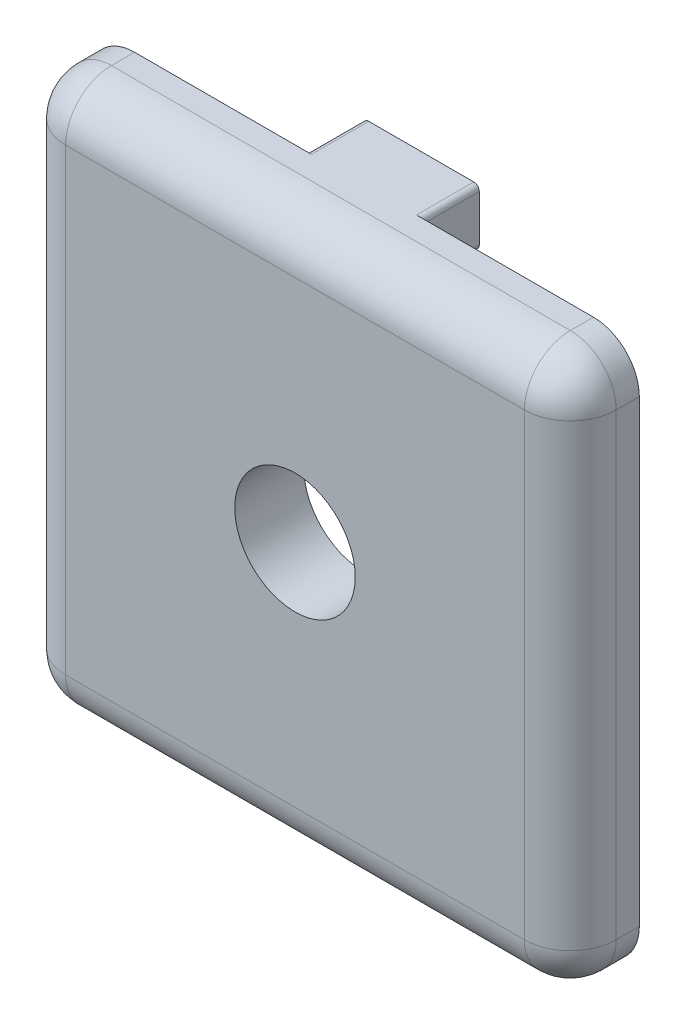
ISO-10303-21;
HEADER;
FILE_DESCRIPTION(('STEP AP214'),'2;1');
FILE_NAME('part.step','',(''),(''),'','','');
FILE_SCHEMA(('AUTOMOTIVE_DESIGN { 1 0 10303 214 1 1 1 1 }'));
ENDSEC;
DATA;
#1=APPLICATION_CONTEXT('core data for automotive mechanical design processes');
#2=APPLICATION_PROTOCOL_DEFINITION('international standard','automotive_design',2000,#1);
#3=PRODUCT_CONTEXT('',#1,'mechanical');
#4=PRODUCT('Part','Part','',(#3));
#5=PRODUCT_RELATED_PRODUCT_CATEGORY('part','',(#4));
#6=PRODUCT_DEFINITION_FORMATION('','',#4);
#7=PRODUCT_DEFINITION_CONTEXT('part definition',#1,'design');
#8=PRODUCT_DEFINITION('design','',#6,#7);
#9=PRODUCT_DEFINITION_SHAPE('','',#8);
#10=(LENGTH_UNIT() NAMED_UNIT(*) SI_UNIT(.MILLI.,.METRE.));
#11=(NAMED_UNIT(*) PLANE_ANGLE_UNIT() SI_UNIT($,.RADIAN.));
#12=(NAMED_UNIT(*) SI_UNIT($,.STERADIAN.) SOLID_ANGLE_UNIT());
#13=UNCERTAINTY_MEASURE_WITH_UNIT(LENGTH_MEASURE(1.E-05),#10,'distance_accuracy_value','');
#14=(GEOMETRIC_REPRESENTATION_CONTEXT(3) GLOBAL_UNCERTAINTY_ASSIGNED_CONTEXT((#13)) GLOBAL_UNIT_ASSIGNED_CONTEXT((#10,
#11,#12)) REPRESENTATION_CONTEXT('',''));
#15=CARTESIAN_POINT('',(0.,0.,0.));
#16=DIRECTION('',(0.,0.,1.));
#17=DIRECTION('',(1.,0.,0.));
#18=AXIS2_PLACEMENT_3D('',#15,#16,#17);
#19=CARTESIAN_POINT('',(-15.875,15.875,0.));
#20=DIRECTION('',(0.,0.,1.));
#21=DIRECTION('',(1.,0.,0.));
#22=AXIS2_PLACEMENT_3D('',#19,#20,#21);
#23=PLANE('',#22);
#24=CARTESIAN_POINT('',(0.,0.,0.));
#25=DIRECTION('',(0.,0.,1.));
#26=DIRECTION('',(1.,0.,0.));
#27=AXIS2_PLACEMENT_3D('',#24,#25,#26);
#28=CIRCLE('',#27,4.1671875);
#29=CARTESIAN_POINT('',(4.1671875,0.,0.));
#30=VERTEX_POINT('',#29);
#31=EDGE_CURVE('E524',#30,#30,#28,.T.);
#32=ORIENTED_EDGE('',*,*,#31,.T.);
#33=EDGE_LOOP('',(#32));
#34=FACE_BOUND('',#33,.T.);
#35=CARTESIAN_POINT('',(3.6322,18.669,0.));
#36=DIRECTION('',(0.,0.,-1.));
#37=DIRECTION('',(-1.,0.,0.));
#38=AXIS2_PLACEMENT_3D('',#35,#36,#37);
#39=CIRCLE('',#38,0.381);
#40=CARTESIAN_POINT('',(3.6322,19.05,0.));
#41=VERTEX_POINT('',#40);
#42=CARTESIAN_POINT('',(4.0132,18.669,0.));
#43=VERTEX_POINT('',#42);
#44=EDGE_CURVE('E491',#41,#43,#39,.T.);
#45=ORIENTED_EDGE('',*,*,#44,.F.);
#46=DIRECTION('',(-1.,0.,0.));
#47=VECTOR('',#46,1.);
#48=CARTESIAN_POINT('',(-15.875,19.05,0.));
#49=LINE('',#48,#47);
#50=CARTESIAN_POINT('',(15.875,19.05,0.));
#51=VERTEX_POINT('',#50);
#52=EDGE_CURVE('E560',#51,#41,#49,.T.);
#53=ORIENTED_EDGE('',*,*,#52,.F.);
#54=CARTESIAN_POINT('',(15.875,15.875,0.));
#55=DIRECTION('',(0.,0.,1.));
#56=DIRECTION('',(-1.,0.,0.));
#57=AXIS2_PLACEMENT_3D('',#54,#55,#56);
#58=CIRCLE('',#57,3.175);
#59=CARTESIAN_POINT('',(19.05,15.875,0.));
#60=VERTEX_POINT('',#59);
#61=EDGE_CURVE('E548',#60,#51,#58,.T.);
#62=ORIENTED_EDGE('',*,*,#61,.F.);
#63=DIRECTION('',(0.,1.,0.));
#64=VECTOR('',#63,1.);
#65=CARTESIAN_POINT('',(19.05,15.875,0.));
#66=LINE('',#65,#64);
#67=CARTESIAN_POINT('',(19.05,-15.875,0.));
#68=VERTEX_POINT('',#67);
#69=EDGE_CURVE('E545',#68,#60,#66,.T.);
#70=ORIENTED_EDGE('',*,*,#69,.F.);
#71=CARTESIAN_POINT('',(15.875,-15.875,0.));
#72=DIRECTION('',(0.,0.,1.));
#73=DIRECTION('',(1.,0.,0.));
#74=AXIS2_PLACEMENT_3D('',#71,#72,#73);
#75=CIRCLE('',#74,3.175);
#76=CARTESIAN_POINT('',(15.875,-19.05,0.));
#77=VERTEX_POINT('',#76);
#78=EDGE_CURVE('E542',#77,#68,#75,.T.);
#79=ORIENTED_EDGE('',*,*,#78,.F.);
#80=DIRECTION('',(1.,0.,0.));
#81=VECTOR('',#80,1.);
#82=CARTESIAN_POINT('',(-15.875,-19.05,0.));
#83=LINE('',#82,#81);
#84=CARTESIAN_POINT('',(-15.875,-19.05,0.));
#85=VERTEX_POINT('',#84);
#86=EDGE_CURVE('E539',#85,#77,#83,.T.);
#87=ORIENTED_EDGE('',*,*,#86,.F.);
#88=CARTESIAN_POINT('',(-15.875,-15.875,0.));
#89=DIRECTION('',(0.,0.,1.));
#90=DIRECTION('',(1.,0.,0.));
#91=AXIS2_PLACEMENT_3D('',#88,#89,#90);
#92=CIRCLE('',#91,3.175);
#93=CARTESIAN_POINT('',(-19.05,-15.875,0.));
#94=VERTEX_POINT('',#93);
#95=EDGE_CURVE('E536',#94,#85,#92,.T.);
#96=ORIENTED_EDGE('',*,*,#95,.F.);
#97=DIRECTION('',(0.,-1.,0.));
#98=VECTOR('',#97,1.);
#99=CARTESIAN_POINT('',(-19.05,15.875,0.));
#100=LINE('',#99,#98);
#101=CARTESIAN_POINT('',(-19.05,15.875,0.));
#102=VERTEX_POINT('',#101);
#103=EDGE_CURVE('E533',#102,#94,#100,.T.);
#104=ORIENTED_EDGE('',*,*,#103,.F.);
#105=CARTESIAN_POINT('',(-15.875,15.875,0.));
#106=DIRECTION('',(0.,0.,1.));
#107=DIRECTION('',(1.,0.,0.));
#108=AXIS2_PLACEMENT_3D('',#105,#106,#107);
#109=CIRCLE('',#108,3.175);
#110=CARTESIAN_POINT('',(-15.875,19.05,0.));
#111=VERTEX_POINT('',#110);
#112=EDGE_CURVE('E530',#111,#102,#109,.T.);
#113=ORIENTED_EDGE('',*,*,#112,.F.);
#114=CARTESIAN_POINT('',(-3.6322,19.05,0.));
#115=VERTEX_POINT('',#114);
#116=EDGE_CURVE('E551',#115,#111,#49,.T.);
#117=ORIENTED_EDGE('',*,*,#116,.F.);
#118=CARTESIAN_POINT('',(-3.6322,18.669,0.));
#119=DIRECTION('',(0.,0.,-1.));
#120=DIRECTION('',(1.,0.,0.));
#121=AXIS2_PLACEMENT_3D('',#118,#119,#120);
#122=CIRCLE('',#121,0.381);
#123=CARTESIAN_POINT('',(-4.0132,18.669,0.));
#124=VERTEX_POINT('',#123);
#125=EDGE_CURVE('E367',#124,#115,#122,.T.);
#126=ORIENTED_EDGE('',*,*,#125,.F.);
#127=DIRECTION('',(0.,1.,0.));
#128=VECTOR('',#127,1.);
#129=CARTESIAN_POINT('',(-4.0132,18.669,0.));
#130=LINE('',#129,#128);
#131=CARTESIAN_POINT('',(-4.0132,15.4686,0.));
#132=VERTEX_POINT('',#131);
#133=EDGE_CURVE('E371',#132,#124,#130,.T.);
#134=ORIENTED_EDGE('',*,*,#133,.F.);
#135=CARTESIAN_POINT('',(-3.6322,15.4686,0.));
#136=DIRECTION('',(0.,0.,-1.));
#137=DIRECTION('',(-1.,0.,0.));
#138=AXIS2_PLACEMENT_3D('',#135,#136,#137);
#139=CIRCLE('',#138,0.380999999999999);
#140=CARTESIAN_POINT('',(-3.6322,15.0876,0.));
#141=VERTEX_POINT('',#140);
#142=EDGE_CURVE('E712',#141,#132,#139,.T.);
#143=ORIENTED_EDGE('',*,*,#142,.F.);
#144=DIRECTION('',(-1.,0.,0.));
#145=VECTOR('',#144,1.);
#146=CARTESIAN_POINT('',(3.6322,15.0876,0.));
#147=LINE('',#146,#145);
#148=CARTESIAN_POINT('',(3.6322,15.0876,0.));
#149=VERTEX_POINT('',#148);
#150=EDGE_CURVE('E477',#149,#141,#147,.T.);
#151=ORIENTED_EDGE('',*,*,#150,.F.);
#152=CARTESIAN_POINT('',(3.6322,15.4686,0.));
#153=DIRECTION('',(0.,0.,-1.));
#154=DIRECTION('',(-1.,0.,0.));
#155=AXIS2_PLACEMENT_3D('',#152,#153,#154);
#156=CIRCLE('',#155,0.380999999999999);
#157=CARTESIAN_POINT('',(4.0132,15.4686,0.));
#158=VERTEX_POINT('',#157);
#159=EDGE_CURVE('E472',#158,#149,#156,.T.);
#160=ORIENTED_EDGE('',*,*,#159,.F.);
#161=DIRECTION('',(0.,-1.,0.));
#162=VECTOR('',#161,1.);
#163=CARTESIAN_POINT('',(4.0132,18.669,0.));
#164=LINE('',#163,#162);
#165=EDGE_CURVE('E474',#43,#158,#164,.T.);
#166=ORIENTED_EDGE('',*,*,#165,.F.);
#167=EDGE_LOOP('',(#45,#53,#62,#70,#79,#87,#96,#104,#113,#117,#126,#134,#143,#151,#160,#166));
#168=FACE_BOUND('',#167,.T.);
#169=ADVANCED_FACE('F350',(#34,#168),#23,.F.);
#170=CARTESIAN_POINT('',(-15.875,15.875,4.7752));
#171=DIRECTION('',(0.,0.,1.));
#172=DIRECTION('',(1.,0.,0.));
#173=AXIS2_PLACEMENT_3D('',#170,#171,#172);
#174=PLANE('',#173);
#175=DIRECTION('',(-1.,0.,0.));
#176=VECTOR('',#175,1.);
#177=CARTESIAN_POINT('',(-15.875,15.875,4.7752));
#178=LINE('',#177,#176);
#179=CARTESIAN_POINT('',(15.875,15.875,4.7752));
#180=VERTEX_POINT('',#179);
#181=CARTESIAN_POINT('',(-15.875,15.875,4.7752));
#182=VERTEX_POINT('',#181);
#183=EDGE_CURVE('E581',#180,#182,#178,.T.);
#184=ORIENTED_EDGE('',*,*,#183,.T.);
#185=DIRECTION('',(0.,-1.,0.));
#186=VECTOR('',#185,1.);
#187=CARTESIAN_POINT('',(-15.875,-15.875,4.7752));
#188=LINE('',#187,#186);
#189=CARTESIAN_POINT('',(-15.875,-15.875,4.7752));
#190=VERTEX_POINT('',#189);
#191=EDGE_CURVE('E574',#182,#190,#188,.T.);
#192=ORIENTED_EDGE('',*,*,#191,.T.);
#193=DIRECTION('',(1.,0.,0.));
#194=VECTOR('',#193,1.);
#195=CARTESIAN_POINT('',(15.875,-15.875,4.7752));
#196=LINE('',#195,#194);
#197=CARTESIAN_POINT('',(15.875,-15.875,4.7752));
#198=VERTEX_POINT('',#197);
#199=EDGE_CURVE('E577',#190,#198,#196,.T.);
#200=ORIENTED_EDGE('',*,*,#199,.T.);
#201=DIRECTION('',(0.,1.,0.));
#202=VECTOR('',#201,1.);
#203=CARTESIAN_POINT('',(15.875,15.875,4.7752));
#204=LINE('',#203,#202);
#205=EDGE_CURVE('E579',#198,#180,#204,.T.);
#206=ORIENTED_EDGE('',*,*,#205,.T.);
#207=EDGE_LOOP('',(#184,#192,#200,#206));
#208=FACE_BOUND('',#207,.T.);
#209=CARTESIAN_POINT('',(0.,0.,4.7752));
#210=DIRECTION('',(0.,0.,1.));
#211=DIRECTION('',(1.,0.,0.));
#212=AXIS2_PLACEMENT_3D('',#209,#210,#211);
#213=CIRCLE('',#212,4.1671875);
#214=CARTESIAN_POINT('',(4.1671875,0.,4.7752));
#215=VERTEX_POINT('',#214);
#216=EDGE_CURVE('E527',#215,#215,#213,.T.);
#217=ORIENTED_EDGE('',*,*,#216,.F.);
#218=EDGE_LOOP('',(#217));
#219=FACE_BOUND('',#218,.T.);
#220=ADVANCED_FACE('F734',(#208,#219),#174,.T.);
#221=CARTESIAN_POINT('',(-15.875,15.875,4.7752));
#222=DIRECTION('',(0.,0.,-1.));
#223=DIRECTION('',(-1.,0.,0.));
#224=AXIS2_PLACEMENT_3D('',#221,#222,#223);
#225=CYLINDRICAL_SURFACE('',#224,3.175);
#226=DIRECTION('',(0.,0.,-1.));
#227=VECTOR('',#226,1.);
#228=CARTESIAN_POINT('',(-19.05,15.875,4.7752));
#229=LINE('',#228,#227);
#230=CARTESIAN_POINT('',(-19.05,15.875,1.6002));
#231=VERTEX_POINT('',#230);
#232=EDGE_CURVE('E586',#231,#102,#229,.T.);
#233=ORIENTED_EDGE('',*,*,#232,.F.);
#234=CARTESIAN_POINT('',(-15.875,15.875,1.6002));
#235=DIRECTION('',(0.,0.,-1.));
#236=DIRECTION('',(-1.,0.,0.));
#237=AXIS2_PLACEMENT_3D('',#234,#235,#236);
#238=CIRCLE('',#237,3.175);
#239=CARTESIAN_POINT('',(-15.875,19.05,1.6002));
#240=VERTEX_POINT('',#239);
#241=EDGE_CURVE('E583',#231,#240,#238,.T.);
#242=ORIENTED_EDGE('',*,*,#241,.T.);
#243=DIRECTION('',(0.,0.,-1.));
#244=VECTOR('',#243,1.);
#245=CARTESIAN_POINT('',(-15.875,19.05,4.7752));
#246=LINE('',#245,#244);
#247=EDGE_CURVE('E554',#240,#111,#246,.T.);
#248=ORIENTED_EDGE('',*,*,#247,.T.);
#249=ORIENTED_EDGE('',*,*,#112,.T.);
#250=EDGE_LOOP('',(#233,#242,#248,#249));
#251=FACE_BOUND('',#250,.T.);
#252=ADVANCED_FACE('F352',(#251),#225,.T.);
#253=CARTESIAN_POINT('',(-19.05,15.875,4.7752));
#254=DIRECTION('',(1.,0.,0.));
#255=DIRECTION('',(0.,0.,-1.));
#256=AXIS2_PLACEMENT_3D('',#253,#254,#255);
#257=PLANE('',#256);
#258=DIRECTION('',(0.,0.,-1.));
#259=VECTOR('',#258,1.);
#260=CARTESIAN_POINT('',(-19.05,-15.875,4.7752));
#261=LINE('',#260,#259);
#262=CARTESIAN_POINT('',(-19.05,-15.875,1.6002));
#263=VERTEX_POINT('',#262);
#264=EDGE_CURVE('E588',#263,#94,#261,.T.);
#265=ORIENTED_EDGE('',*,*,#264,.F.);
#266=DIRECTION('',(0.,-1.,0.));
#267=VECTOR('',#266,1.);
#268=CARTESIAN_POINT('',(-19.05,15.875,1.6002));
#269=LINE('',#268,#267);
#270=EDGE_CURVE('E572',#263,#231,#269,.F.);
#271=ORIENTED_EDGE('',*,*,#270,.T.);
#272=ORIENTED_EDGE('',*,*,#232,.T.);
#273=ORIENTED_EDGE('',*,*,#103,.T.);
#274=EDGE_LOOP('',(#265,#271,#272,#273));
#275=FACE_BOUND('',#274,.T.);
#276=ADVANCED_FACE('F611',(#275),#257,.F.);
#277=CARTESIAN_POINT('',(-15.875,-15.875,4.7752));
#278=DIRECTION('',(0.,0.,-1.));
#279=DIRECTION('',(-1.,0.,0.));
#280=AXIS2_PLACEMENT_3D('',#277,#278,#279);
#281=CYLINDRICAL_SURFACE('',#280,3.175);
#282=DIRECTION('',(0.,0.,-1.));
#283=VECTOR('',#282,1.);
#284=CARTESIAN_POINT('',(-15.875,-19.05,4.7752));
#285=LINE('',#284,#283);
#286=CARTESIAN_POINT('',(-15.875,-19.05,1.6002));
#287=VERTEX_POINT('',#286);
#288=EDGE_CURVE('E590',#287,#85,#285,.T.);
#289=ORIENTED_EDGE('',*,*,#288,.F.);
#290=CARTESIAN_POINT('',(-15.875,-15.875,1.6002));
#291=DIRECTION('',(0.,0.,-1.));
#292=DIRECTION('',(-1.,0.,0.));
#293=AXIS2_PLACEMENT_3D('',#290,#291,#292);
#294=CIRCLE('',#293,3.175);
#295=EDGE_CURVE('E570',#287,#263,#294,.T.);
#296=ORIENTED_EDGE('',*,*,#295,.T.);
#297=ORIENTED_EDGE('',*,*,#264,.T.);
#298=ORIENTED_EDGE('',*,*,#95,.T.);
#299=EDGE_LOOP('',(#289,#296,#297,#298));
#300=FACE_BOUND('',#299,.T.);
#301=ADVANCED_FACE('F664',(#300),#281,.T.);
#302=CARTESIAN_POINT('',(-15.875,-19.05,4.7752));
#303=DIRECTION('',(0.,1.,0.));
#304=DIRECTION('',(0.,0.,1.));
#305=AXIS2_PLACEMENT_3D('',#302,#303,#304);
#306=PLANE('',#305);
#307=DIRECTION('',(0.,0.,-1.));
#308=VECTOR('',#307,1.);
#309=CARTESIAN_POINT('',(15.875,-19.05,4.7752));
#310=LINE('',#309,#308);
#311=CARTESIAN_POINT('',(15.875,-19.05,1.6002));
#312=VERTEX_POINT('',#311);
#313=EDGE_CURVE('E592',#312,#77,#310,.T.);
#314=ORIENTED_EDGE('',*,*,#313,.F.);
#315=DIRECTION('',(1.,0.,0.));
#316=VECTOR('',#315,1.);
#317=CARTESIAN_POINT('',(-15.875,-19.05,1.6002));
#318=LINE('',#317,#316);
#319=EDGE_CURVE('E568',#312,#287,#318,.F.);
#320=ORIENTED_EDGE('',*,*,#319,.T.);
#321=ORIENTED_EDGE('',*,*,#288,.T.);
#322=ORIENTED_EDGE('',*,*,#86,.T.);
#323=EDGE_LOOP('',(#314,#320,#321,#322));
#324=FACE_BOUND('',#323,.T.);
#325=ADVANCED_FACE('F662',(#324),#306,.F.);
#326=CARTESIAN_POINT('',(15.875,-15.875,4.7752));
#327=DIRECTION('',(0.,0.,-1.));
#328=DIRECTION('',(-1.,0.,0.));
#329=AXIS2_PLACEMENT_3D('',#326,#327,#328);
#330=CYLINDRICAL_SURFACE('',#329,3.175);
#331=DIRECTION('',(0.,0.,-1.));
#332=VECTOR('',#331,1.);
#333=CARTESIAN_POINT('',(19.05,-15.875,4.7752));
#334=LINE('',#333,#332);
#335=CARTESIAN_POINT('',(19.05,-15.875,1.6002));
#336=VERTEX_POINT('',#335);
#337=EDGE_CURVE('E594',#336,#68,#334,.T.);
#338=ORIENTED_EDGE('',*,*,#337,.F.);
#339=CARTESIAN_POINT('',(15.875,-15.875,1.6002));
#340=DIRECTION('',(0.,0.,-1.));
#341=DIRECTION('',(-1.,0.,0.));
#342=AXIS2_PLACEMENT_3D('',#339,#340,#341);
#343=CIRCLE('',#342,3.175);
#344=EDGE_CURVE('E566',#336,#312,#343,.T.);
#345=ORIENTED_EDGE('',*,*,#344,.T.);
#346=ORIENTED_EDGE('',*,*,#313,.T.);
#347=ORIENTED_EDGE('',*,*,#78,.T.);
#348=EDGE_LOOP('',(#338,#345,#346,#347));
#349=FACE_BOUND('',#348,.T.);
#350=ADVANCED_FACE('F647',(#349),#330,.T.);
#351=CARTESIAN_POINT('',(19.05,15.875,4.7752));
#352=DIRECTION('',(-1.,0.,0.));
#353=DIRECTION('',(0.,0.,1.));
#354=AXIS2_PLACEMENT_3D('',#351,#352,#353);
#355=PLANE('',#354);
#356=DIRECTION('',(0.,0.,-1.));
#357=VECTOR('',#356,1.);
#358=CARTESIAN_POINT('',(19.05,15.875,4.7752));
#359=LINE('',#358,#357);
#360=CARTESIAN_POINT('',(19.05,15.875,1.6002));
#361=VERTEX_POINT('',#360);
#362=EDGE_CURVE('E596',#361,#60,#359,.T.);
#363=ORIENTED_EDGE('',*,*,#362,.F.);
#364=DIRECTION('',(0.,1.,0.));
#365=VECTOR('',#364,1.);
#366=CARTESIAN_POINT('',(19.05,-15.875,1.6002));
#367=LINE('',#366,#365);
#368=EDGE_CURVE('E564',#361,#336,#367,.F.);
#369=ORIENTED_EDGE('',*,*,#368,.T.);
#370=ORIENTED_EDGE('',*,*,#337,.T.);
#371=ORIENTED_EDGE('',*,*,#69,.T.);
#372=EDGE_LOOP('',(#363,#369,#370,#371));
#373=FACE_BOUND('',#372,.T.);
#374=ADVANCED_FACE('F644',(#373),#355,.F.);
#375=CARTESIAN_POINT('',(15.875,15.875,4.7752));
#376=DIRECTION('',(0.,0.,-1.));
#377=DIRECTION('',(-1.,0.,0.));
#378=AXIS2_PLACEMENT_3D('',#375,#376,#377);
#379=CYLINDRICAL_SURFACE('',#378,3.175);
#380=DIRECTION('',(0.,0.,-1.));
#381=VECTOR('',#380,1.);
#382=CARTESIAN_POINT('',(15.875,19.05,4.7752));
#383=LINE('',#382,#381);
#384=CARTESIAN_POINT('',(15.875,19.05,1.6002));
#385=VERTEX_POINT('',#384);
#386=EDGE_CURVE('E597',#385,#51,#383,.T.);
#387=ORIENTED_EDGE('',*,*,#386,.F.);
#388=CARTESIAN_POINT('',(15.875,15.875,1.6002));
#389=DIRECTION('',(0.,0.,-1.));
#390=DIRECTION('',(-1.,0.,0.));
#391=AXIS2_PLACEMENT_3D('',#388,#389,#390);
#392=CIRCLE('',#391,3.175);
#393=EDGE_CURVE('E359',#385,#361,#392,.T.);
#394=ORIENTED_EDGE('',*,*,#393,.T.);
#395=ORIENTED_EDGE('',*,*,#362,.T.);
#396=ORIENTED_EDGE('',*,*,#61,.T.);
#397=EDGE_LOOP('',(#387,#394,#395,#396));
#398=FACE_BOUND('',#397,.T.);
#399=ADVANCED_FACE('F630',(#398),#379,.T.);
#400=CARTESIAN_POINT('',(-15.875,19.05,4.7752));
#401=DIRECTION('',(0.,-1.,0.));
#402=DIRECTION('',(0.,0.,-1.));
#403=AXIS2_PLACEMENT_3D('',#400,#401,#402);
#404=PLANE('',#403);
#405=ORIENTED_EDGE('',*,*,#247,.F.);
#406=DIRECTION('',(-1.,0.,0.));
#407=VECTOR('',#406,1.);
#408=CARTESIAN_POINT('',(15.875,19.05,1.6002));
#409=LINE('',#408,#407);
#410=EDGE_CURVE('E11',#240,#385,#409,.F.);
#411=ORIENTED_EDGE('',*,*,#410,.T.);
#412=ORIENTED_EDGE('',*,*,#386,.T.);
#413=ORIENTED_EDGE('',*,*,#52,.T.);
#414=DIRECTION('',(0.,0.,1.));
#415=VECTOR('',#414,1.);
#416=CARTESIAN_POINT('',(3.6322,19.05,-3.9624));
#417=LINE('',#416,#415);
#418=CARTESIAN_POINT('',(3.6322,19.05,-3.9624));
#419=VERTEX_POINT('',#418);
#420=EDGE_CURVE('E668',#419,#41,#417,.T.);
#421=ORIENTED_EDGE('',*,*,#420,.F.);
#422=DIRECTION('',(1.,0.,0.));
#423=VECTOR('',#422,1.);
#424=CARTESIAN_POINT('',(3.6322,19.05,-3.9624));
#425=LINE('',#424,#423);
#426=CARTESIAN_POINT('',(-3.6322,19.05,-3.9624));
#427=VERTEX_POINT('',#426);
#428=EDGE_CURVE('E675',#427,#419,#425,.T.);
#429=ORIENTED_EDGE('',*,*,#428,.F.);
#430=DIRECTION('',(0.,0.,1.));
#431=VECTOR('',#430,1.);
#432=CARTESIAN_POINT('',(-3.6322,19.05,-3.9624));
#433=LINE('',#432,#431);
#434=EDGE_CURVE('E674',#427,#115,#433,.T.);
#435=ORIENTED_EDGE('',*,*,#434,.T.);
#436=ORIENTED_EDGE('',*,*,#116,.T.);
#437=EDGE_LOOP('',(#405,#411,#412,#413,#421,#429,#435,#436));
#438=FACE_BOUND('',#437,.T.);
#439=ADVANCED_FACE('F627',(#438),#404,.F.);
#440=CARTESIAN_POINT('',(0.,0.,4.7752));
#441=DIRECTION('',(0.,0.,-1.));
#442=DIRECTION('',(-1.,0.,0.));
#443=AXIS2_PLACEMENT_3D('',#440,#441,#442);
#444=CYLINDRICAL_SURFACE('',#443,4.1671875);
#445=ORIENTED_EDGE('',*,*,#216,.T.);
#446=EDGE_LOOP('',(#445));
#447=FACE_BOUND('',#446,.T.);
#448=ORIENTED_EDGE('',*,*,#31,.F.);
#449=EDGE_LOOP('',(#448));
#450=FACE_BOUND('',#449,.T.);
#451=ADVANCED_FACE('F744',(#447,#450),#444,.F.);
#452=CARTESIAN_POINT('',(15.875,-15.875,1.6002));
#453=DIRECTION('',(0.,0.,1.));
#454=DIRECTION('',(1.,0.,0.));
#455=AXIS2_PLACEMENT_3D('',#452,#453,#454);
#456=SPHERICAL_SURFACE('',#455,3.175);
#457=CARTESIAN_POINT('',(15.875,-15.875,1.6002));
#458=DIRECTION('',(-1.,0.,0.));
#459=DIRECTION('',(0.,-1.,0.));
#460=AXIS2_PLACEMENT_3D('',#457,#458,#459);
#461=CIRCLE('',#460,3.175);
#462=EDGE_CURVE('E518',#312,#198,#461,.T.);
#463=ORIENTED_EDGE('',*,*,#462,.F.);
#464=ORIENTED_EDGE('',*,*,#344,.F.);
#465=CARTESIAN_POINT('',(15.875,-15.875,1.6002));
#466=DIRECTION('',(0.,1.,0.));
#467=DIRECTION('',(-1.,0.,0.));
#468=AXIS2_PLACEMENT_3D('',#465,#466,#467);
#469=CIRCLE('',#468,3.175);
#470=EDGE_CURVE('E521',#198,#336,#469,.T.);
#471=ORIENTED_EDGE('',*,*,#470,.F.);
#472=EDGE_LOOP('',(#463,#464,#471));
#473=FACE_BOUND('',#472,.T.);
#474=ADVANCED_FACE('F653',(#473),#456,.T.);
#475=CARTESIAN_POINT('',(15.875,15.875,1.6002));
#476=DIRECTION('',(0.,-1.,0.));
#477=DIRECTION('',(0.,0.,-1.));
#478=AXIS2_PLACEMENT_3D('',#475,#476,#477);
#479=CYLINDRICAL_SURFACE('',#478,3.175);
#480=ORIENTED_EDGE('',*,*,#470,.T.);
#481=ORIENTED_EDGE('',*,*,#368,.F.);
#482=CARTESIAN_POINT('',(15.875,15.875,1.6002));
#483=DIRECTION('',(0.,1.,0.));
#484=DIRECTION('',(0.,0.,1.));
#485=AXIS2_PLACEMENT_3D('',#482,#483,#484);
#486=CIRCLE('',#485,3.175);
#487=EDGE_CURVE('E515',#180,#361,#486,.T.);
#488=ORIENTED_EDGE('',*,*,#487,.F.);
#489=ORIENTED_EDGE('',*,*,#205,.F.);
#490=EDGE_LOOP('',(#480,#481,#488,#489));
#491=FACE_BOUND('',#490,.T.);
#492=ADVANCED_FACE('F640',(#491),#479,.T.);
#493=CARTESIAN_POINT('',(-15.875,-15.875,1.6002));
#494=DIRECTION('',(-1.,0.,0.));
#495=DIRECTION('',(0.,0.,1.));
#496=AXIS2_PLACEMENT_3D('',#493,#494,#495);
#497=CYLINDRICAL_SURFACE('',#496,3.175);
#498=ORIENTED_EDGE('',*,*,#462,.T.);
#499=ORIENTED_EDGE('',*,*,#199,.F.);
#500=CARTESIAN_POINT('',(-15.875,-15.875,1.6002));
#501=DIRECTION('',(-1.,0.,0.));
#502=DIRECTION('',(0.,0.,1.));
#503=AXIS2_PLACEMENT_3D('',#500,#501,#502);
#504=CIRCLE('',#503,3.175);
#505=EDGE_CURVE('E512',#287,#190,#504,.T.);
#506=ORIENTED_EDGE('',*,*,#505,.F.);
#507=ORIENTED_EDGE('',*,*,#319,.F.);
#508=EDGE_LOOP('',(#498,#499,#506,#507));
#509=FACE_BOUND('',#508,.T.);
#510=ADVANCED_FACE('F658',(#509),#497,.T.);
#511=CARTESIAN_POINT('',(15.875,15.875,1.6002));
#512=DIRECTION('',(0.,0.,1.));
#513=DIRECTION('',(1.,0.,0.));
#514=AXIS2_PLACEMENT_3D('',#511,#512,#513);
#515=SPHERICAL_SURFACE('',#514,3.175);
#516=ORIENTED_EDGE('',*,*,#487,.T.);
#517=ORIENTED_EDGE('',*,*,#393,.F.);
#518=CARTESIAN_POINT('',(15.875,15.875,1.6002));
#519=DIRECTION('',(-1.,0.,0.));
#520=DIRECTION('',(0.,-1.,0.));
#521=AXIS2_PLACEMENT_3D('',#518,#519,#520);
#522=CIRCLE('',#521,3.175);
#523=EDGE_CURVE('E509',#180,#385,#522,.T.);
#524=ORIENTED_EDGE('',*,*,#523,.F.);
#525=EDGE_LOOP('',(#516,#517,#524));
#526=FACE_BOUND('',#525,.T.);
#527=ADVANCED_FACE('F635',(#526),#515,.T.);
#528=CARTESIAN_POINT('',(-15.875,-15.875,1.6002));
#529=DIRECTION('',(0.,0.,1.));
#530=DIRECTION('',(1.,0.,0.));
#531=AXIS2_PLACEMENT_3D('',#528,#529,#530);
#532=SPHERICAL_SURFACE('',#531,3.175);
#533=ORIENTED_EDGE('',*,*,#295,.F.);
#534=ORIENTED_EDGE('',*,*,#505,.T.);
#535=CARTESIAN_POINT('',(-15.875,-15.875,1.6002));
#536=DIRECTION('',(0.,1.,0.));
#537=DIRECTION('',(0.,0.,1.));
#538=AXIS2_PLACEMENT_3D('',#535,#536,#537);
#539=CIRCLE('',#538,3.175);
#540=EDGE_CURVE('E507',#263,#190,#539,.T.);
#541=ORIENTED_EDGE('',*,*,#540,.F.);
#542=EDGE_LOOP('',(#533,#534,#541));
#543=FACE_BOUND('',#542,.T.);
#544=ADVANCED_FACE('F802',(#543),#532,.T.);
#545=CARTESIAN_POINT('',(-15.875,15.875,1.6002));
#546=DIRECTION('',(1.,0.,0.));
#547=DIRECTION('',(0.,0.,-1.));
#548=AXIS2_PLACEMENT_3D('',#545,#546,#547);
#549=CYLINDRICAL_SURFACE('',#548,3.175);
#550=ORIENTED_EDGE('',*,*,#523,.T.);
#551=ORIENTED_EDGE('',*,*,#410,.F.);
#552=CARTESIAN_POINT('',(-15.875,15.875,1.6002));
#553=DIRECTION('',(-1.,0.,0.));
#554=DIRECTION('',(0.,0.,1.));
#555=AXIS2_PLACEMENT_3D('',#552,#553,#554);
#556=CIRCLE('',#555,3.175);
#557=EDGE_CURVE('E505',#182,#240,#556,.T.);
#558=ORIENTED_EDGE('',*,*,#557,.F.);
#559=ORIENTED_EDGE('',*,*,#183,.F.);
#560=EDGE_LOOP('',(#550,#551,#558,#559));
#561=FACE_BOUND('',#560,.T.);
#562=ADVANCED_FACE('F625',(#561),#549,.T.);
#563=CARTESIAN_POINT('',(-15.875,15.875,1.6002));
#564=DIRECTION('',(0.,1.,0.));
#565=DIRECTION('',(0.,0.,1.));
#566=AXIS2_PLACEMENT_3D('',#563,#564,#565);
#567=CYLINDRICAL_SURFACE('',#566,3.175);
#568=ORIENTED_EDGE('',*,*,#540,.T.);
#569=ORIENTED_EDGE('',*,*,#191,.F.);
#570=CARTESIAN_POINT('',(-15.875,15.875,1.6002));
#571=DIRECTION('',(0.,1.,0.));
#572=DIRECTION('',(0.,0.,1.));
#573=AXIS2_PLACEMENT_3D('',#570,#571,#572);
#574=CIRCLE('',#573,3.175);
#575=EDGE_CURVE('E497',#231,#182,#574,.T.);
#576=ORIENTED_EDGE('',*,*,#575,.F.);
#577=ORIENTED_EDGE('',*,*,#270,.F.);
#578=EDGE_LOOP('',(#568,#569,#576,#577));
#579=FACE_BOUND('',#578,.T.);
#580=ADVANCED_FACE('F621',(#579),#567,.T.);
#581=CARTESIAN_POINT('',(-15.875,15.875,1.6002));
#582=DIRECTION('',(0.,0.,1.));
#583=DIRECTION('',(1.,0.,0.));
#584=AXIS2_PLACEMENT_3D('',#581,#582,#583);
#585=SPHERICAL_SURFACE('',#584,3.175);
#586=ORIENTED_EDGE('',*,*,#557,.T.);
#587=ORIENTED_EDGE('',*,*,#241,.F.);
#588=ORIENTED_EDGE('',*,*,#575,.T.);
#589=EDGE_LOOP('',(#586,#587,#588));
#590=FACE_BOUND('',#589,.T.);
#591=ADVANCED_FACE('F616',(#590),#585,.T.);
#592=CARTESIAN_POINT('',(3.6322,18.669,-3.9624));
#593=DIRECTION('',(0.,0.,1.));
#594=DIRECTION('',(1.,0.,0.));
#595=AXIS2_PLACEMENT_3D('',#592,#593,#594);
#596=CYLINDRICAL_SURFACE('',#595,0.381);
#597=ORIENTED_EDGE('',*,*,#44,.T.);
#598=DIRECTION('',(0.,0.,1.));
#599=VECTOR('',#598,1.);
#600=CARTESIAN_POINT('',(4.0132,18.669,-3.9624));
#601=LINE('',#600,#599);
#602=CARTESIAN_POINT('',(4.0132,18.669,-3.9624));
#603=VERTEX_POINT('',#602);
#604=EDGE_CURVE('E489',#603,#43,#601,.T.);
#605=ORIENTED_EDGE('',*,*,#604,.F.);
#606=CARTESIAN_POINT('',(3.6322,18.669,-3.9624));
#607=DIRECTION('',(0.,0.,-1.));
#608=DIRECTION('',(-1.,0.,0.));
#609=AXIS2_PLACEMENT_3D('',#606,#607,#608);
#610=CIRCLE('',#609,0.381);
#611=EDGE_CURVE('E673',#419,#603,#610,.T.);
#612=ORIENTED_EDGE('',*,*,#611,.F.);
#613=ORIENTED_EDGE('',*,*,#420,.T.);
#614=EDGE_LOOP('',(#597,#605,#612,#613));
#615=FACE_BOUND('',#614,.T.);
#616=ADVANCED_FACE('F671',(#615),#596,.T.);
#617=CARTESIAN_POINT('',(4.0132,18.669,-3.9624));
#618=DIRECTION('',(-1.,0.,0.));
#619=DIRECTION('',(0.,0.,1.));
#620=AXIS2_PLACEMENT_3D('',#617,#618,#619);
#621=PLANE('',#620);
#622=ORIENTED_EDGE('',*,*,#165,.T.);
#623=DIRECTION('',(0.,0.,1.));
#624=VECTOR('',#623,1.);
#625=CARTESIAN_POINT('',(4.0132,15.4686,-3.9624));
#626=LINE('',#625,#624);
#627=CARTESIAN_POINT('',(4.0132,15.4686,-3.9624));
#628=VERTEX_POINT('',#627);
#629=EDGE_CURVE('E486',#628,#158,#626,.T.);
#630=ORIENTED_EDGE('',*,*,#629,.F.);
#631=DIRECTION('',(0.,-1.,0.));
#632=VECTOR('',#631,1.);
#633=CARTESIAN_POINT('',(4.0132,18.669,-3.9624));
#634=LINE('',#633,#632);
#635=EDGE_CURVE('E692',#603,#628,#634,.T.);
#636=ORIENTED_EDGE('',*,*,#635,.F.);
#637=ORIENTED_EDGE('',*,*,#604,.T.);
#638=EDGE_LOOP('',(#622,#630,#636,#637));
#639=FACE_BOUND('',#638,.T.);
#640=ADVANCED_FACE('F485',(#639),#621,.F.);
#641=CARTESIAN_POINT('',(3.6322,15.4686,-3.9624));
#642=DIRECTION('',(0.,0.,1.));
#643=DIRECTION('',(1.,0.,0.));
#644=AXIS2_PLACEMENT_3D('',#641,#642,#643);
#645=CYLINDRICAL_SURFACE('',#644,0.380999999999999);
#646=ORIENTED_EDGE('',*,*,#159,.T.);
#647=DIRECTION('',(0.,0.,1.));
#648=VECTOR('',#647,1.);
#649=CARTESIAN_POINT('',(3.6322,15.0876,-3.9624));
#650=LINE('',#649,#648);
#651=CARTESIAN_POINT('',(3.6322,15.0876,-3.9624));
#652=VERTEX_POINT('',#651);
#653=EDGE_CURVE('E495',#652,#149,#650,.T.);
#654=ORIENTED_EDGE('',*,*,#653,.F.);
#655=CARTESIAN_POINT('',(3.6322,15.4686,-3.9624));
#656=DIRECTION('',(0.,0.,-1.));
#657=DIRECTION('',(-1.,0.,0.));
#658=AXIS2_PLACEMENT_3D('',#655,#656,#657);
#659=CIRCLE('',#658,0.380999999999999);
#660=EDGE_CURVE('E494',#628,#652,#659,.T.);
#661=ORIENTED_EDGE('',*,*,#660,.F.);
#662=ORIENTED_EDGE('',*,*,#629,.T.);
#663=EDGE_LOOP('',(#646,#654,#661,#662));
#664=FACE_BOUND('',#663,.T.);
#665=ADVANCED_FACE('F493',(#664),#645,.T.);
#666=CARTESIAN_POINT('',(3.6322,15.0876,-3.9624));
#667=DIRECTION('',(0.,1.,0.));
#668=DIRECTION('',(0.,0.,1.));
#669=AXIS2_PLACEMENT_3D('',#666,#667,#668);
#670=PLANE('',#669);
#671=ORIENTED_EDGE('',*,*,#150,.T.);
#672=DIRECTION('',(0.,0.,1.));
#673=VECTOR('',#672,1.);
#674=CARTESIAN_POINT('',(-3.6322,15.0876,-3.9624));
#675=LINE('',#674,#673);
#676=CARTESIAN_POINT('',(-3.6322,15.0876,-3.9624));
#677=VERTEX_POINT('',#676);
#678=EDGE_CURVE('E499',#677,#141,#675,.T.);
#679=ORIENTED_EDGE('',*,*,#678,.F.);
#680=DIRECTION('',(-1.,0.,0.));
#681=VECTOR('',#680,1.);
#682=CARTESIAN_POINT('',(3.6322,15.0876,-3.9624));
#683=LINE('',#682,#681);
#684=EDGE_CURVE('E695',#652,#677,#683,.T.);
#685=ORIENTED_EDGE('',*,*,#684,.F.);
#686=ORIENTED_EDGE('',*,*,#653,.T.);
#687=EDGE_LOOP('',(#671,#679,#685,#686));
#688=FACE_BOUND('',#687,.T.);
#689=ADVANCED_FACE('F715',(#688),#670,.F.);
#690=CARTESIAN_POINT('',(-3.6322,15.4686,-3.9624));
#691=DIRECTION('',(0.,0.,1.));
#692=DIRECTION('',(1.,0.,0.));
#693=AXIS2_PLACEMENT_3D('',#690,#691,#692);
#694=CYLINDRICAL_SURFACE('',#693,0.380999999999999);
#695=ORIENTED_EDGE('',*,*,#142,.T.);
#696=DIRECTION('',(0.,0.,1.));
#697=VECTOR('',#696,1.);
#698=CARTESIAN_POINT('',(-4.0132,15.4686,-3.9624));
#699=LINE('',#698,#697);
#700=CARTESIAN_POINT('',(-4.0132,15.4686,-3.9624));
#701=VERTEX_POINT('',#700);
#702=EDGE_CURVE('E704',#701,#132,#699,.T.);
#703=ORIENTED_EDGE('',*,*,#702,.F.);
#704=CARTESIAN_POINT('',(-3.6322,15.4686,-3.9624));
#705=DIRECTION('',(0.,0.,-1.));
#706=DIRECTION('',(-1.,0.,0.));
#707=AXIS2_PLACEMENT_3D('',#704,#705,#706);
#708=CIRCLE('',#707,0.380999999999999);
#709=EDGE_CURVE('E697',#677,#701,#708,.T.);
#710=ORIENTED_EDGE('',*,*,#709,.F.);
#711=ORIENTED_EDGE('',*,*,#678,.T.);
#712=EDGE_LOOP('',(#695,#703,#710,#711));
#713=FACE_BOUND('',#712,.T.);
#714=ADVANCED_FACE('F710',(#713),#694,.T.);
#715=CARTESIAN_POINT('',(-4.0132,18.669,-3.9624));
#716=DIRECTION('',(1.,0.,0.));
#717=DIRECTION('',(0.,0.,-1.));
#718=AXIS2_PLACEMENT_3D('',#715,#716,#717);
#719=PLANE('',#718);
#720=ORIENTED_EDGE('',*,*,#133,.T.);
#721=DIRECTION('',(0.,0.,1.));
#722=VECTOR('',#721,1.);
#723=CARTESIAN_POINT('',(-4.0132,18.669,-3.9624));
#724=LINE('',#723,#722);
#725=CARTESIAN_POINT('',(-4.0132,18.669,-3.9624));
#726=VERTEX_POINT('',#725);
#727=EDGE_CURVE('E678',#726,#124,#724,.T.);
#728=ORIENTED_EDGE('',*,*,#727,.F.);
#729=DIRECTION('',(0.,1.,0.));
#730=VECTOR('',#729,1.);
#731=CARTESIAN_POINT('',(-4.0132,18.669,-3.9624));
#732=LINE('',#731,#730);
#733=EDGE_CURVE('E699',#701,#726,#732,.T.);
#734=ORIENTED_EDGE('',*,*,#733,.F.);
#735=ORIENTED_EDGE('',*,*,#702,.T.);
#736=EDGE_LOOP('',(#720,#728,#734,#735));
#737=FACE_BOUND('',#736,.T.);
#738=ADVANCED_FACE('F719',(#737),#719,.F.);
#739=CARTESIAN_POINT('',(-3.6322,18.669,-3.9624));
#740=DIRECTION('',(0.,0.,1.));
#741=DIRECTION('',(1.,0.,0.));
#742=AXIS2_PLACEMENT_3D('',#739,#740,#741);
#743=CYLINDRICAL_SURFACE('',#742,0.381);
#744=ORIENTED_EDGE('',*,*,#125,.T.);
#745=ORIENTED_EDGE('',*,*,#434,.F.);
#746=CARTESIAN_POINT('',(-3.6322,18.669,-3.9624));
#747=DIRECTION('',(0.,0.,-1.));
#748=DIRECTION('',(1.,0.,0.));
#749=AXIS2_PLACEMENT_3D('',#746,#747,#748);
#750=CIRCLE('',#749,0.381);
#751=EDGE_CURVE('E679',#726,#427,#750,.T.);
#752=ORIENTED_EDGE('',*,*,#751,.F.);
#753=ORIENTED_EDGE('',*,*,#727,.T.);
#754=EDGE_LOOP('',(#744,#745,#752,#753));
#755=FACE_BOUND('',#754,.T.);
#756=ADVANCED_FACE('F723',(#755),#743,.T.);
#757=CARTESIAN_POINT('',(3.6322,18.669,-3.9624));
#758=DIRECTION('',(0.,0.,-1.));
#759=DIRECTION('',(-1.,0.,0.));
#760=AXIS2_PLACEMENT_3D('',#757,#758,#759);
#761=PLANE('',#760);
#762=ORIENTED_EDGE('',*,*,#611,.T.);
#763=ORIENTED_EDGE('',*,*,#635,.T.);
#764=ORIENTED_EDGE('',*,*,#660,.T.);
#765=ORIENTED_EDGE('',*,*,#684,.T.);
#766=ORIENTED_EDGE('',*,*,#709,.T.);
#767=ORIENTED_EDGE('',*,*,#733,.T.);
#768=ORIENTED_EDGE('',*,*,#751,.T.);
#769=ORIENTED_EDGE('',*,*,#428,.T.);
#770=EDGE_LOOP('',(#762,#763,#764,#765,#766,#767,#768,#769));
#771=FACE_BOUND('',#770,.T.);
#772=ADVANCED_FACE('F726',(#771),#761,.T.);
#773=CLOSED_SHELL('',(#169,#220,#252,#276,#301,#325,#350,#374,#399,#439,#451,#474,#492,#510,
#527,#544,#562,#580,#591,#616,#640,#665,#689,#714,#738,#756,#772));
#774=MANIFOLD_SOLID_BREP('B2',#773);
#775=ADVANCED_BREP_SHAPE_REPRESENTATION('',(#18,#774),#14);
#776=SHAPE_DEFINITION_REPRESENTATION(#9,#775);
ENDSEC;
END-ISO-10303-21;
